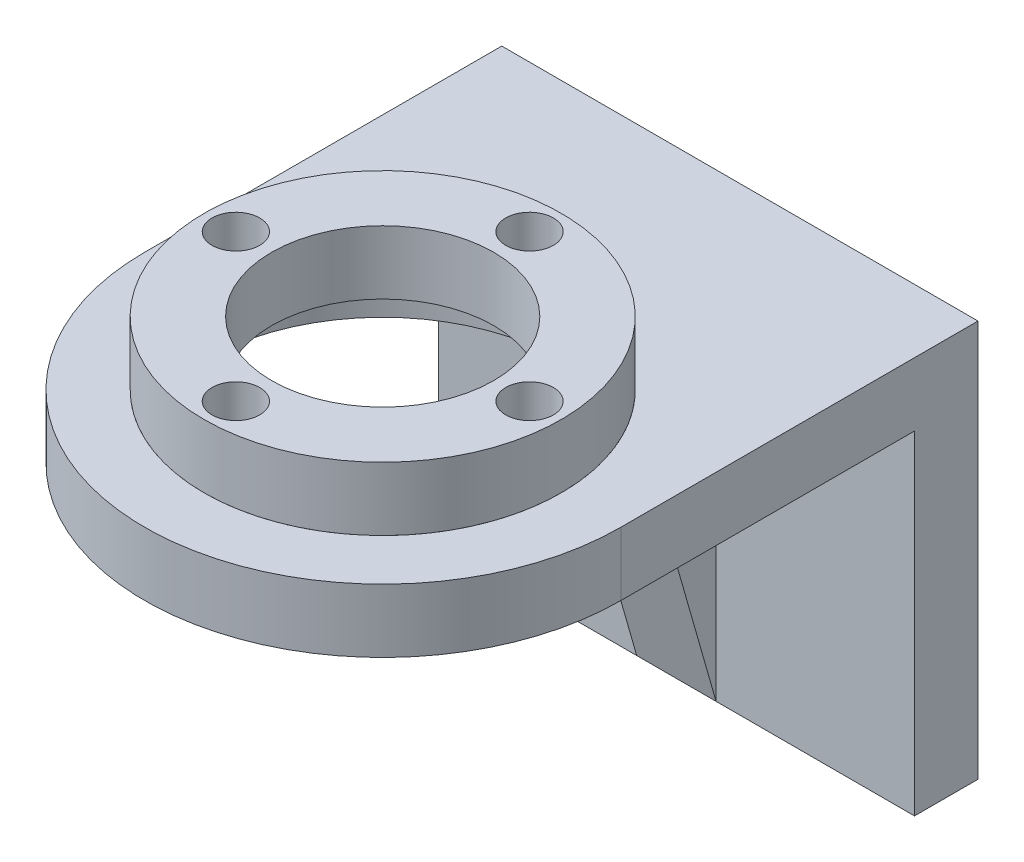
ISO-10303-21;
HEADER;
FILE_DESCRIPTION(('STEP AP214'),'2;1');
FILE_NAME('part.step','',(''),(''),'','','');
FILE_SCHEMA(('AUTOMOTIVE_DESIGN { 1 0 10303 214 1 1 1 1 }'));
ENDSEC;
DATA;
#1=APPLICATION_CONTEXT('core data for automotive mechanical design processes');
#2=APPLICATION_PROTOCOL_DEFINITION('international standard','automotive_design',2000,#1);
#3=PRODUCT_CONTEXT('',#1,'mechanical');
#4=PRODUCT('Part','Part','',(#3));
#5=PRODUCT_RELATED_PRODUCT_CATEGORY('part','',(#4));
#6=PRODUCT_DEFINITION_FORMATION('','',#4);
#7=PRODUCT_DEFINITION_CONTEXT('part definition',#1,'design');
#8=PRODUCT_DEFINITION('design','',#6,#7);
#9=PRODUCT_DEFINITION_SHAPE('','',#8);
#10=(LENGTH_UNIT() NAMED_UNIT(*) SI_UNIT(.MILLI.,.METRE.));
#11=(NAMED_UNIT(*) PLANE_ANGLE_UNIT() SI_UNIT($,.RADIAN.));
#12=(NAMED_UNIT(*) SI_UNIT($,.STERADIAN.) SOLID_ANGLE_UNIT());
#13=UNCERTAINTY_MEASURE_WITH_UNIT(LENGTH_MEASURE(1.E-05),#10,'distance_accuracy_value','');
#14=(GEOMETRIC_REPRESENTATION_CONTEXT(3) GLOBAL_UNCERTAINTY_ASSIGNED_CONTEXT((#13)) GLOBAL_UNIT_ASSIGNED_CONTEXT((#10,
#11,#12)) REPRESENTATION_CONTEXT('',''));
#15=CARTESIAN_POINT('',(0.,0.,0.));
#16=DIRECTION('',(0.,0.,1.));
#17=DIRECTION('',(1.,0.,0.));
#18=AXIS2_PLACEMENT_3D('',#15,#16,#17);
#19=CARTESIAN_POINT('',(0.,37.,45.));
#20=DIRECTION('',(0.,-1.,0.));
#21=DIRECTION('',(0.,0.,-1.));
#22=AXIS2_PLACEMENT_3D('',#19,#20,#21);
#23=CYLINDRICAL_SURFACE('',#22,22.5);
#24=CARTESIAN_POINT('',(0.,37.,45.));
#25=DIRECTION('',(0.,1.,0.));
#26=DIRECTION('',(0.,0.,1.));
#27=AXIS2_PLACEMENT_3D('',#24,#25,#26);
#28=CIRCLE('',#27,22.5);
#29=CARTESIAN_POINT('',(0.,37.,67.5));
#30=VERTEX_POINT('',#29);
#31=EDGE_CURVE('E11',#30,#30,#28,.T.);
#32=ORIENTED_EDGE('',*,*,#31,.F.);
#33=EDGE_LOOP('',(#32));
#34=FACE_BOUND('',#33,.T.);
#35=CARTESIAN_POINT('',(0.,29.,45.));
#36=DIRECTION('',(0.,1.,0.));
#37=DIRECTION('',(0.,0.,1.));
#38=AXIS2_PLACEMENT_3D('',#35,#36,#37);
#39=CIRCLE('',#38,22.5);
#40=CARTESIAN_POINT('',(0.,29.,67.5));
#41=VERTEX_POINT('',#40);
#42=EDGE_CURVE('E48',#41,#41,#39,.T.);
#43=ORIENTED_EDGE('',*,*,#42,.T.);
#44=EDGE_LOOP('',(#43));
#45=FACE_BOUND('',#44,.T.);
#46=ADVANCED_FACE('F45',(#34,#45),#23,.T.);
#47=CARTESIAN_POINT('',(0.,37.,45.));
#48=DIRECTION('',(0.,1.,0.));
#49=DIRECTION('',(0.,0.,1.));
#50=AXIS2_PLACEMENT_3D('',#47,#48,#49);
#51=PLANE('',#50);
#52=CARTESIAN_POINT('',(18.5,37.,44.9999999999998));
#53=DIRECTION('',(0.,-1.,0.));
#54=DIRECTION('',(0.,0.,-1.));
#55=AXIS2_PLACEMENT_3D('',#52,#53,#54);
#56=CIRCLE('',#55,3.);
#57=CARTESIAN_POINT('',(18.5,37.,41.9999999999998));
#58=VERTEX_POINT('',#57);
#59=EDGE_CURVE('E78',#58,#58,#56,.T.);
#60=ORIENTED_EDGE('',*,*,#59,.T.);
#61=EDGE_LOOP('',(#60));
#62=FACE_BOUND('',#61,.T.);
#63=CARTESIAN_POINT('',(1.29184884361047E-13,37.,63.5));
#64=DIRECTION('',(0.,-1.,0.));
#65=DIRECTION('',(0.,0.,-1.));
#66=AXIS2_PLACEMENT_3D('',#63,#64,#65);
#67=CIRCLE('',#66,3.);
#68=CARTESIAN_POINT('',(1.29184884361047E-13,37.,60.5));
#69=VERTEX_POINT('',#68);
#70=EDGE_CURVE('E72',#69,#69,#67,.T.);
#71=ORIENTED_EDGE('',*,*,#70,.T.);
#72=EDGE_LOOP('',(#71));
#73=FACE_BOUND('',#72,.T.);
#74=CARTESIAN_POINT('',(-18.5,37.,45.0000000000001));
#75=DIRECTION('',(0.,-1.,0.));
#76=DIRECTION('',(0.,0.,-1.));
#77=AXIS2_PLACEMENT_3D('',#74,#75,#76);
#78=CIRCLE('',#77,3.);
#79=CARTESIAN_POINT('',(-18.5,37.,42.0000000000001));
#80=VERTEX_POINT('',#79);
#81=EDGE_CURVE('E66',#80,#80,#78,.T.);
#82=ORIENTED_EDGE('',*,*,#81,.T.);
#83=EDGE_LOOP('',(#82));
#84=FACE_BOUND('',#83,.T.);
#85=CARTESIAN_POINT('',(0.,37.,26.5));
#86=DIRECTION('',(0.,-1.,0.));
#87=DIRECTION('',(0.,0.,-1.));
#88=AXIS2_PLACEMENT_3D('',#85,#86,#87);
#89=CIRCLE('',#88,3.);
#90=CARTESIAN_POINT('',(0.,37.,23.5));
#91=VERTEX_POINT('',#90);
#92=EDGE_CURVE('E60',#91,#91,#89,.T.);
#93=ORIENTED_EDGE('',*,*,#92,.T.);
#94=EDGE_LOOP('',(#93));
#95=FACE_BOUND('',#94,.T.);
#96=CARTESIAN_POINT('',(0.,37.,45.));
#97=DIRECTION('',(0.,-1.,0.));
#98=DIRECTION('',(0.,0.,-1.));
#99=AXIS2_PLACEMENT_3D('',#96,#97,#98);
#100=CIRCLE('',#99,14.);
#101=CARTESIAN_POINT('',(0.,37.,31.));
#102=VERTEX_POINT('',#101);
#103=EDGE_CURVE('E55',#102,#102,#100,.T.);
#104=ORIENTED_EDGE('',*,*,#103,.T.);
#105=EDGE_LOOP('',(#104));
#106=FACE_BOUND('',#105,.T.);
#107=ORIENTED_EDGE('',*,*,#31,.T.);
#108=EDGE_LOOP('',(#107));
#109=FACE_BOUND('',#108,.T.);
#110=ADVANCED_FACE('F87',(#62,#73,#84,#95,#106,#109),#51,.T.);
#111=CARTESIAN_POINT('',(0.,29.,45.));
#112=DIRECTION('',(0.,1.,0.));
#113=DIRECTION('',(0.,0.,1.));
#114=AXIS2_PLACEMENT_3D('',#111,#112,#113);
#115=PLANE('',#114);
#116=CARTESIAN_POINT('',(18.5,29.,44.9999999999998));
#117=DIRECTION('',(0.,-1.,0.));
#118=DIRECTION('',(0.,0.,-1.));
#119=AXIS2_PLACEMENT_3D('',#116,#117,#118);
#120=CIRCLE('',#119,3.);
#121=CARTESIAN_POINT('',(18.5,29.,41.9999999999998));
#122=VERTEX_POINT('',#121);
#123=EDGE_CURVE('E81',#122,#122,#120,.T.);
#124=ORIENTED_EDGE('',*,*,#123,.F.);
#125=EDGE_LOOP('',(#124));
#126=FACE_BOUND('',#125,.T.);
#127=CARTESIAN_POINT('',(1.29184884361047E-13,29.,63.5));
#128=DIRECTION('',(0.,-1.,0.));
#129=DIRECTION('',(0.,0.,-1.));
#130=AXIS2_PLACEMENT_3D('',#127,#128,#129);
#131=CIRCLE('',#130,3.);
#132=CARTESIAN_POINT('',(1.29184884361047E-13,29.,60.5));
#133=VERTEX_POINT('',#132);
#134=EDGE_CURVE('E75',#133,#133,#131,.T.);
#135=ORIENTED_EDGE('',*,*,#134,.F.);
#136=EDGE_LOOP('',(#135));
#137=FACE_BOUND('',#136,.T.);
#138=CARTESIAN_POINT('',(-18.5,29.,45.0000000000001));
#139=DIRECTION('',(0.,-1.,0.));
#140=DIRECTION('',(0.,0.,-1.));
#141=AXIS2_PLACEMENT_3D('',#138,#139,#140);
#142=CIRCLE('',#141,3.);
#143=CARTESIAN_POINT('',(-18.5,29.,42.0000000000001));
#144=VERTEX_POINT('',#143);
#145=EDGE_CURVE('E69',#144,#144,#142,.T.);
#146=ORIENTED_EDGE('',*,*,#145,.F.);
#147=EDGE_LOOP('',(#146));
#148=FACE_BOUND('',#147,.T.);
#149=CARTESIAN_POINT('',(0.,29.,26.5));
#150=DIRECTION('',(0.,-1.,0.));
#151=DIRECTION('',(0.,0.,-1.));
#152=AXIS2_PLACEMENT_3D('',#149,#150,#151);
#153=CIRCLE('',#152,3.);
#154=CARTESIAN_POINT('',(0.,29.,23.5));
#155=VERTEX_POINT('',#154);
#156=EDGE_CURVE('E63',#155,#155,#153,.T.);
#157=ORIENTED_EDGE('',*,*,#156,.F.);
#158=EDGE_LOOP('',(#157));
#159=FACE_BOUND('',#158,.T.);
#160=CARTESIAN_POINT('',(0.,29.,45.));
#161=DIRECTION('',(0.,-1.,0.));
#162=DIRECTION('',(0.,0.,-1.));
#163=AXIS2_PLACEMENT_3D('',#160,#161,#162);
#164=CIRCLE('',#163,14.);
#165=CARTESIAN_POINT('',(0.,29.,31.));
#166=VERTEX_POINT('',#165);
#167=EDGE_CURVE('E57',#166,#166,#164,.T.);
#168=ORIENTED_EDGE('',*,*,#167,.F.);
#169=EDGE_LOOP('',(#168));
#170=FACE_BOUND('',#169,.T.);
#171=ORIENTED_EDGE('',*,*,#42,.F.);
#172=EDGE_LOOP('',(#171));
#173=FACE_BOUND('',#172,.T.);
#174=ADVANCED_FACE('F97',(#126,#137,#148,#159,#170,#173),#115,.F.);
#175=CARTESIAN_POINT('',(0.,37.,45.));
#176=DIRECTION('',(0.,-1.,0.));
#177=DIRECTION('',(0.,0.,-1.));
#178=AXIS2_PLACEMENT_3D('',#175,#176,#177);
#179=CYLINDRICAL_SURFACE('',#178,14.);
#180=ORIENTED_EDGE('',*,*,#103,.F.);
#181=EDGE_LOOP('',(#180));
#182=FACE_BOUND('',#181,.T.);
#183=ORIENTED_EDGE('',*,*,#167,.T.);
#184=EDGE_LOOP('',(#183));
#185=FACE_BOUND('',#184,.T.);
#186=ADVANCED_FACE('F100',(#182,#185),#179,.F.);
#187=CARTESIAN_POINT('',(0.,37.,26.5));
#188=DIRECTION('',(0.,-1.,0.));
#189=DIRECTION('',(0.,0.,-1.));
#190=AXIS2_PLACEMENT_3D('',#187,#188,#189);
#191=CYLINDRICAL_SURFACE('',#190,3.);
#192=ORIENTED_EDGE('',*,*,#92,.F.);
#193=EDGE_LOOP('',(#192));
#194=FACE_BOUND('',#193,.T.);
#195=ORIENTED_EDGE('',*,*,#156,.T.);
#196=EDGE_LOOP('',(#195));
#197=FACE_BOUND('',#196,.T.);
#198=ADVANCED_FACE('F122',(#194,#197),#191,.F.);
#199=CARTESIAN_POINT('',(-18.5,37.,45.0000000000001));
#200=DIRECTION('',(0.,-1.,0.));
#201=DIRECTION('',(0.,0.,-1.));
#202=AXIS2_PLACEMENT_3D('',#199,#200,#201);
#203=CYLINDRICAL_SURFACE('',#202,3.);
#204=ORIENTED_EDGE('',*,*,#81,.F.);
#205=EDGE_LOOP('',(#204));
#206=FACE_BOUND('',#205,.T.);
#207=ORIENTED_EDGE('',*,*,#145,.T.);
#208=EDGE_LOOP('',(#207));
#209=FACE_BOUND('',#208,.T.);
#210=ADVANCED_FACE('F126',(#206,#209),#203,.F.);
#211=CARTESIAN_POINT('',(1.29184884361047E-13,37.,63.5));
#212=DIRECTION('',(0.,-1.,0.));
#213=DIRECTION('',(0.,0.,-1.));
#214=AXIS2_PLACEMENT_3D('',#211,#212,#213);
#215=CYLINDRICAL_SURFACE('',#214,3.);
#216=ORIENTED_EDGE('',*,*,#70,.F.);
#217=EDGE_LOOP('',(#216));
#218=FACE_BOUND('',#217,.T.);
#219=ORIENTED_EDGE('',*,*,#134,.T.);
#220=EDGE_LOOP('',(#219));
#221=FACE_BOUND('',#220,.T.);
#222=ADVANCED_FACE('F93',(#218,#221),#215,.F.);
#223=CARTESIAN_POINT('',(18.5,37.,44.9999999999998));
#224=DIRECTION('',(0.,-1.,0.));
#225=DIRECTION('',(0.,0.,-1.));
#226=AXIS2_PLACEMENT_3D('',#223,#224,#225);
#227=CYLINDRICAL_SURFACE('',#226,3.);
#228=ORIENTED_EDGE('',*,*,#59,.F.);
#229=EDGE_LOOP('',(#228));
#230=FACE_BOUND('',#229,.T.);
#231=ORIENTED_EDGE('',*,*,#123,.T.);
#232=EDGE_LOOP('',(#231));
#233=FACE_BOUND('',#232,.T.);
#234=ADVANCED_FACE('F90',(#230,#233),#227,.F.);
#235=CLOSED_SHELL('',(#46,#110,#174,#186,#198,#210,#222,#234));
#236=MANIFOLD_SOLID_BREP('B2',#235);
#237=CARTESIAN_POINT('',(0.,0.,8.));
#238=DIRECTION('',(0.,0.,1.));
#239=DIRECTION('',(1.,0.,0.));
#240=AXIS2_PLACEMENT_3D('',#237,#238,#239);
#241=PLANE('',#240);
#242=CARTESIAN_POINT('',(-20.,-11.,8.));
#243=DIRECTION('',(0.,0.,1.));
#244=DIRECTION('',(1.,0.,0.));
#245=AXIS2_PLACEMENT_3D('',#242,#243,#244);
#246=CIRCLE('',#245,6.);
#247=CARTESIAN_POINT('',(-14.,-11.,8.));
#248=VERTEX_POINT('',#247);
#249=EDGE_CURVE('E366',#248,#248,#246,.T.);
#250=ORIENTED_EDGE('',*,*,#249,.F.);
#251=EDGE_LOOP('',(#250));
#252=FACE_BOUND('',#251,.T.);
#253=DIRECTION('',(1.,0.,0.));
#254=VECTOR('',#253,1.);
#255=CARTESIAN_POINT('',(-30.,-21.,8.));
#256=LINE('',#255,#254);
#257=CARTESIAN_POINT('',(-30.,-21.,8.));
#258=VERTEX_POINT('',#257);
#259=CARTESIAN_POINT('',(-5.,-21.,8.));
#260=VERTEX_POINT('',#259);
#261=EDGE_CURVE('E291',#258,#260,#256,.T.);
#262=ORIENTED_EDGE('',*,*,#261,.T.);
#263=DIRECTION('',(0.,1.,0.));
#264=VECTOR('',#263,1.);
#265=CARTESIAN_POINT('',(-5.,0.,8.));
#266=LINE('',#265,#264);
#267=CARTESIAN_POINT('',(-5.,21.,8.));
#268=VERTEX_POINT('',#267);
#269=EDGE_CURVE('E272',#260,#268,#266,.T.);
#270=ORIENTED_EDGE('',*,*,#269,.T.);
#271=DIRECTION('',(-1.,0.,0.));
#272=VECTOR('',#271,1.);
#273=CARTESIAN_POINT('',(-30.,21.,8.));
#274=LINE('',#273,#272);
#275=CARTESIAN_POINT('',(-30.,21.,8.));
#276=VERTEX_POINT('',#275);
#277=EDGE_CURVE('E195',#268,#276,#274,.T.);
#278=ORIENTED_EDGE('',*,*,#277,.T.);
#279=DIRECTION('',(0.,-1.,0.));
#280=VECTOR('',#279,1.);
#281=CARTESIAN_POINT('',(-30.,21.,8.));
#282=LINE('',#281,#280);
#283=EDGE_CURVE('E295',#276,#258,#282,.T.);
#284=ORIENTED_EDGE('',*,*,#283,.T.);
#285=EDGE_LOOP('',(#262,#270,#278,#284));
#286=FACE_BOUND('',#285,.T.);
#287=ADVANCED_FACE('F191',(#252,#286),#241,.T.);
#288=CARTESIAN_POINT('',(30.,21.,8.));
#289=DIRECTION('',(-1.,0.,0.));
#290=DIRECTION('',(0.,0.,1.));
#291=AXIS2_PLACEMENT_3D('',#288,#289,#290);
#292=PLANE('',#291);
#293=DIRECTION('',(0.,1.,0.));
#294=VECTOR('',#293,1.);
#295=CARTESIAN_POINT('',(30.,21.,0.));
#296=LINE('',#295,#294);
#297=CARTESIAN_POINT('',(30.,-21.,0.));
#298=VERTEX_POINT('',#297);
#299=CARTESIAN_POINT('',(30.,29.,0.));
#300=VERTEX_POINT('',#299);
#301=EDGE_CURVE('E302',#298,#300,#296,.T.);
#302=ORIENTED_EDGE('',*,*,#301,.T.);
#303=DIRECTION('',(0.,0.,-1.));
#304=VECTOR('',#303,1.);
#305=CARTESIAN_POINT('',(30.,29.,0.));
#306=LINE('',#305,#304);
#307=CARTESIAN_POINT('',(30.,29.,45.));
#308=VERTEX_POINT('',#307);
#309=EDGE_CURVE('E345',#308,#300,#306,.T.);
#310=ORIENTED_EDGE('',*,*,#309,.F.);
#311=DIRECTION('',(0.,-1.,0.));
#312=VECTOR('',#311,1.);
#313=CARTESIAN_POINT('',(30.,29.,45.));
#314=LINE('',#313,#312);
#315=CARTESIAN_POINT('',(30.,21.,45.));
#316=VERTEX_POINT('',#315);
#317=EDGE_CURVE('E326',#308,#316,#314,.T.);
#318=ORIENTED_EDGE('',*,*,#317,.T.);
#319=DIRECTION('',(0.,0.,-1.));
#320=VECTOR('',#319,1.);
#321=CARTESIAN_POINT('',(30.,21.,0.));
#322=LINE('',#321,#320);
#323=CARTESIAN_POINT('',(30.,21.,7.99999999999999));
#324=VERTEX_POINT('',#323);
#325=EDGE_CURVE('E323',#316,#324,#322,.T.);
#326=ORIENTED_EDGE('',*,*,#325,.T.);
#327=DIRECTION('',(0.,1.,0.));
#328=VECTOR('',#327,1.);
#329=CARTESIAN_POINT('',(30.,21.,8.));
#330=LINE('',#329,#328);
#331=CARTESIAN_POINT('',(30.,-21.,8.));
#332=VERTEX_POINT('',#331);
#333=EDGE_CURVE('E307',#332,#324,#330,.T.);
#334=ORIENTED_EDGE('',*,*,#333,.F.);
#335=DIRECTION('',(0.,0.,-1.));
#336=VECTOR('',#335,1.);
#337=CARTESIAN_POINT('',(30.,-21.,8.));
#338=LINE('',#337,#336);
#339=EDGE_CURVE('E201',#332,#298,#338,.T.);
#340=ORIENTED_EDGE('',*,*,#339,.T.);
#341=EDGE_LOOP('',(#302,#310,#318,#326,#334,#340));
#342=FACE_BOUND('',#341,.T.);
#343=ADVANCED_FACE('F193',(#342),#292,.F.);
#344=CARTESIAN_POINT('',(-30.,21.,8.));
#345=DIRECTION('',(1.,0.,0.));
#346=DIRECTION('',(0.,1.,0.));
#347=AXIS2_PLACEMENT_3D('',#344,#345,#346);
#348=PLANE('',#347);
#349=DIRECTION('',(0.,-1.,0.));
#350=VECTOR('',#349,1.);
#351=CARTESIAN_POINT('',(-30.,21.,0.));
#352=LINE('',#351,#350);
#353=CARTESIAN_POINT('',(-30.,29.,0.));
#354=VERTEX_POINT('',#353);
#355=CARTESIAN_POINT('',(-30.,-21.,0.));
#356=VERTEX_POINT('',#355);
#357=EDGE_CURVE('E304',#354,#356,#352,.T.);
#358=ORIENTED_EDGE('',*,*,#357,.T.);
#359=DIRECTION('',(0.,0.,-1.));
#360=VECTOR('',#359,1.);
#361=CARTESIAN_POINT('',(-30.,-21.,8.));
#362=LINE('',#361,#360);
#363=EDGE_CURVE('E43',#258,#356,#362,.T.);
#364=ORIENTED_EDGE('',*,*,#363,.F.);
#365=ORIENTED_EDGE('',*,*,#283,.F.);
#366=DIRECTION('',(0.,0.,1.));
#367=VECTOR('',#366,1.);
#368=CARTESIAN_POINT('',(-30.,21.,0.));
#369=LINE('',#368,#367);
#370=CARTESIAN_POINT('',(-30.,21.,45.));
#371=VERTEX_POINT('',#370);
#372=EDGE_CURVE('E329',#276,#371,#369,.T.);
#373=ORIENTED_EDGE('',*,*,#372,.T.);
#374=DIRECTION('',(0.,-1.,0.));
#375=VECTOR('',#374,1.);
#376=CARTESIAN_POINT('',(-30.,29.,45.));
#377=LINE('',#376,#375);
#378=CARTESIAN_POINT('',(-30.,29.,45.));
#379=VERTEX_POINT('',#378);
#380=EDGE_CURVE('E305',#379,#371,#377,.T.);
#381=ORIENTED_EDGE('',*,*,#380,.F.);
#382=DIRECTION('',(0.,0.,1.));
#383=VECTOR('',#382,1.);
#384=CARTESIAN_POINT('',(-30.,29.,0.));
#385=LINE('',#384,#383);
#386=EDGE_CURVE('E347',#354,#379,#385,.T.);
#387=ORIENTED_EDGE('',*,*,#386,.F.);
#388=EDGE_LOOP('',(#358,#364,#365,#373,#381,#387));
#389=FACE_BOUND('',#388,.T.);
#390=ADVANCED_FACE('F386',(#389),#348,.F.);
#391=CARTESIAN_POINT('',(-30.,-21.,8.));
#392=DIRECTION('',(0.,1.,0.));
#393=DIRECTION('',(0.,0.,1.));
#394=AXIS2_PLACEMENT_3D('',#391,#392,#393);
#395=PLANE('',#394);
#396=CARTESIAN_POINT('',(5.,-21.,8.));
#397=VERTEX_POINT('',#396);
#398=EDGE_CURVE('E218',#397,#332,#256,.T.);
#399=ORIENTED_EDGE('',*,*,#398,.F.);
#400=DIRECTION('',(-1.,0.,0.));
#401=VECTOR('',#400,1.);
#402=CARTESIAN_POINT('',(0.,-21.,8.));
#403=LINE('',#402,#401);
#404=EDGE_CURVE('E283',#260,#397,#403,.F.);
#405=ORIENTED_EDGE('',*,*,#404,.F.);
#406=ORIENTED_EDGE('',*,*,#261,.F.);
#407=ORIENTED_EDGE('',*,*,#363,.T.);
#408=DIRECTION('',(1.,0.,0.));
#409=VECTOR('',#408,1.);
#410=CARTESIAN_POINT('',(-30.,-21.,0.));
#411=LINE('',#410,#409);
#412=EDGE_CURVE('E232',#356,#298,#411,.T.);
#413=ORIENTED_EDGE('',*,*,#412,.T.);
#414=ORIENTED_EDGE('',*,*,#339,.F.);
#415=EDGE_LOOP('',(#399,#405,#406,#407,#413,#414));
#416=FACE_BOUND('',#415,.T.);
#417=ADVANCED_FACE('F290',(#416),#395,.F.);
#418=DIRECTION('',(0.,1.,0.));
#419=VECTOR('',#418,1.);
#420=CARTESIAN_POINT('',(5.,0.,8.));
#421=LINE('',#420,#419);
#422=CARTESIAN_POINT('',(5.,21.,8.));
#423=VERTEX_POINT('',#422);
#424=EDGE_CURVE('E362',#397,#423,#421,.T.);
#425=ORIENTED_EDGE('',*,*,#424,.F.);
#426=ORIENTED_EDGE('',*,*,#398,.T.);
#427=ORIENTED_EDGE('',*,*,#333,.T.);
#428=EDGE_CURVE('E309',#324,#423,#274,.T.);
#429=ORIENTED_EDGE('',*,*,#428,.T.);
#430=EDGE_LOOP('',(#425,#426,#427,#429));
#431=FACE_BOUND('',#430,.T.);
#432=ADVANCED_FACE('F317',(#431),#241,.T.);
#433=CARTESIAN_POINT('',(0.,0.,0.));
#434=DIRECTION('',(0.,0.,1.));
#435=DIRECTION('',(1.,0.,0.));
#436=AXIS2_PLACEMENT_3D('',#433,#434,#435);
#437=PLANE('',#436);
#438=CARTESIAN_POINT('',(-20.,-11.,0.));
#439=DIRECTION('',(0.,0.,1.));
#440=DIRECTION('',(1.,0.,0.));
#441=AXIS2_PLACEMENT_3D('',#438,#439,#440);
#442=CIRCLE('',#441,6.);
#443=CARTESIAN_POINT('',(-14.,-11.,0.));
#444=VERTEX_POINT('',#443);
#445=EDGE_CURVE('E287',#444,#444,#442,.T.);
#446=ORIENTED_EDGE('',*,*,#445,.T.);
#447=EDGE_LOOP('',(#446));
#448=FACE_BOUND('',#447,.T.);
#449=ORIENTED_EDGE('',*,*,#301,.F.);
#450=ORIENTED_EDGE('',*,*,#412,.F.);
#451=ORIENTED_EDGE('',*,*,#357,.F.);
#452=DIRECTION('',(-1.,0.,0.));
#453=VECTOR('',#452,1.);
#454=CARTESIAN_POINT('',(30.,29.,0.));
#455=LINE('',#454,#453);
#456=EDGE_CURVE('E351',#300,#354,#455,.T.);
#457=ORIENTED_EDGE('',*,*,#456,.F.);
#458=EDGE_LOOP('',(#449,#450,#451,#457));
#459=FACE_BOUND('',#458,.T.);
#460=ADVANCED_FACE('F372',(#448,#459),#437,.F.);
#461=CARTESIAN_POINT('',(0.,21.,45.));
#462=DIRECTION('',(0.,-1.,0.));
#463=DIRECTION('',(0.,0.,-1.));
#464=AXIS2_PLACEMENT_3D('',#461,#462,#463);
#465=PLANE('',#464);
#466=DIRECTION('',(0.,0.,1.));
#467=VECTOR('',#466,1.);
#468=CARTESIAN_POINT('',(5.,21.,45.));
#469=LINE('',#468,#467);
#470=CARTESIAN_POINT('',(5.,21.,20.));
#471=VERTEX_POINT('',#470);
#472=EDGE_CURVE('E360',#423,#471,#469,.T.);
#473=ORIENTED_EDGE('',*,*,#472,.F.);
#474=ORIENTED_EDGE('',*,*,#428,.F.);
#475=ORIENTED_EDGE('',*,*,#325,.F.);
#476=CARTESIAN_POINT('',(0.,21.,45.));
#477=DIRECTION('',(0.,1.,0.));
#478=DIRECTION('',(0.,0.,-1.));
#479=AXIS2_PLACEMENT_3D('',#476,#477,#478);
#480=CIRCLE('',#479,30.);
#481=EDGE_CURVE('E332',#371,#316,#480,.T.);
#482=ORIENTED_EDGE('',*,*,#481,.F.);
#483=ORIENTED_EDGE('',*,*,#372,.F.);
#484=ORIENTED_EDGE('',*,*,#277,.F.);
#485=DIRECTION('',(0.,0.,1.));
#486=VECTOR('',#485,1.);
#487=CARTESIAN_POINT('',(-5.,21.,45.));
#488=LINE('',#487,#486);
#489=CARTESIAN_POINT('',(-5.,21.,20.));
#490=VERTEX_POINT('',#489);
#491=EDGE_CURVE('E275',#268,#490,#488,.T.);
#492=ORIENTED_EDGE('',*,*,#491,.T.);
#493=DIRECTION('',(1.,0.,0.));
#494=VECTOR('',#493,1.);
#495=CARTESIAN_POINT('',(0.,21.,20.));
#496=LINE('',#495,#494);
#497=EDGE_CURVE('E286',#471,#490,#496,.F.);
#498=ORIENTED_EDGE('',*,*,#497,.F.);
#499=EDGE_LOOP('',(#473,#474,#475,#482,#483,#484,#492,#498));
#500=FACE_BOUND('',#499,.T.);
#501=CARTESIAN_POINT('',(0.,21.,45.));
#502=DIRECTION('',(0.,-1.,0.));
#503=DIRECTION('',(0.,0.,-1.));
#504=AXIS2_PLACEMENT_3D('',#501,#502,#503);
#505=CIRCLE('',#504,22.5);
#506=CARTESIAN_POINT('',(0.,21.,22.5));
#507=VERTEX_POINT('',#506);
#508=EDGE_CURVE('E292',#507,#507,#505,.T.);
#509=ORIENTED_EDGE('',*,*,#508,.F.);
#510=EDGE_LOOP('',(#509));
#511=FACE_BOUND('',#510,.T.);
#512=ADVANCED_FACE('F394',(#500,#511),#465,.T.);
#513=CARTESIAN_POINT('',(0.,29.,45.));
#514=DIRECTION('',(0.,-1.,0.));
#515=DIRECTION('',(0.,0.,-1.));
#516=AXIS2_PLACEMENT_3D('',#513,#514,#515);
#517=CYLINDRICAL_SURFACE('',#516,30.);
#518=ORIENTED_EDGE('',*,*,#481,.T.);
#519=ORIENTED_EDGE('',*,*,#317,.F.);
#520=CARTESIAN_POINT('',(0.,29.,45.));
#521=DIRECTION('',(0.,1.,0.));
#522=DIRECTION('',(0.,0.,-1.));
#523=AXIS2_PLACEMENT_3D('',#520,#521,#522);
#524=CIRCLE('',#523,30.);
#525=EDGE_CURVE('E341',#379,#308,#524,.T.);
#526=ORIENTED_EDGE('',*,*,#525,.F.);
#527=ORIENTED_EDGE('',*,*,#380,.T.);
#528=EDGE_LOOP('',(#518,#519,#526,#527));
#529=FACE_BOUND('',#528,.T.);
#530=ADVANCED_FACE('F407',(#529),#517,.T.);
#531=CARTESIAN_POINT('',(0.,29.,45.));
#532=DIRECTION('',(0.,-1.,0.));
#533=DIRECTION('',(0.,0.,-1.));
#534=AXIS2_PLACEMENT_3D('',#531,#532,#533);
#535=PLANE('',#534);
#536=CARTESIAN_POINT('',(0.,29.,45.));
#537=DIRECTION('',(0.,-1.,0.));
#538=DIRECTION('',(0.,0.,-1.));
#539=AXIS2_PLACEMENT_3D('',#536,#537,#538);
#540=CIRCLE('',#539,22.5);
#541=CARTESIAN_POINT('',(0.,29.,22.5));
#542=VERTEX_POINT('',#541);
#543=EDGE_CURVE('E330',#542,#542,#540,.T.);
#544=ORIENTED_EDGE('',*,*,#543,.T.);
#545=EDGE_LOOP('',(#544));
#546=FACE_BOUND('',#545,.T.);
#547=ORIENTED_EDGE('',*,*,#456,.T.);
#548=ORIENTED_EDGE('',*,*,#386,.T.);
#549=ORIENTED_EDGE('',*,*,#525,.T.);
#550=ORIENTED_EDGE('',*,*,#309,.T.);
#551=EDGE_LOOP('',(#547,#548,#549,#550));
#552=FACE_BOUND('',#551,.T.);
#553=ADVANCED_FACE('F404',(#546,#552),#535,.F.);
#554=CARTESIAN_POINT('',(0.,29.,45.));
#555=DIRECTION('',(0.,-1.,0.));
#556=DIRECTION('',(0.,0.,-1.));
#557=AXIS2_PLACEMENT_3D('',#554,#555,#556);
#558=CYLINDRICAL_SURFACE('',#557,22.5);
#559=ORIENTED_EDGE('',*,*,#543,.F.);
#560=EDGE_LOOP('',(#559));
#561=FACE_BOUND('',#560,.T.);
#562=ORIENTED_EDGE('',*,*,#508,.T.);
#563=EDGE_LOOP('',(#562));
#564=FACE_BOUND('',#563,.T.);
#565=ADVANCED_FACE('F406',(#561,#564),#558,.F.);
#566=CARTESIAN_POINT('',(0.,-21.,8.));
#567=DIRECTION('',(0.,0.274721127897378,-0.961523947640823));
#568=DIRECTION('',(0.,0.961523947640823,0.274721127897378));
#569=AXIS2_PLACEMENT_3D('',#566,#567,#568);
#570=PLANE('',#569);
#571=DIRECTION('',(0.,0.961523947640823,0.274721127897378));
#572=VECTOR('',#571,1.);
#573=CARTESIAN_POINT('',(-5.,-21.,8.));
#574=LINE('',#573,#572);
#575=EDGE_CURVE('E209',#260,#490,#574,.T.);
#576=ORIENTED_EDGE('',*,*,#575,.F.);
#577=ORIENTED_EDGE('',*,*,#404,.T.);
#578=DIRECTION('',(0.,0.961523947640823,0.274721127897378));
#579=VECTOR('',#578,1.);
#580=CARTESIAN_POINT('',(5.,-21.,8.));
#581=LINE('',#580,#579);
#582=EDGE_CURVE('E277',#397,#471,#581,.T.);
#583=ORIENTED_EDGE('',*,*,#582,.T.);
#584=ORIENTED_EDGE('',*,*,#497,.T.);
#585=EDGE_LOOP('',(#576,#577,#583,#584));
#586=FACE_BOUND('',#585,.T.);
#587=ADVANCED_FACE('F281',(#586),#570,.F.);
#588=CARTESIAN_POINT('',(5.,3.9999875,37.5));
#589=DIRECTION('',(1.,0.,0.));
#590=DIRECTION('',(0.,0.,-1.));
#591=AXIS2_PLACEMENT_3D('',#588,#589,#590);
#592=PLANE('',#591);
#593=ORIENTED_EDGE('',*,*,#424,.T.);
#594=ORIENTED_EDGE('',*,*,#472,.T.);
#595=ORIENTED_EDGE('',*,*,#582,.F.);
#596=EDGE_LOOP('',(#593,#594,#595));
#597=FACE_BOUND('',#596,.T.);
#598=ADVANCED_FACE('F427',(#597),#592,.T.);
#599=CARTESIAN_POINT('',(-5.,3.9999875,37.5));
#600=DIRECTION('',(1.,0.,0.));
#601=DIRECTION('',(0.,0.,-1.));
#602=AXIS2_PLACEMENT_3D('',#599,#600,#601);
#603=PLANE('',#602);
#604=ORIENTED_EDGE('',*,*,#491,.F.);
#605=ORIENTED_EDGE('',*,*,#269,.F.);
#606=ORIENTED_EDGE('',*,*,#575,.T.);
#607=EDGE_LOOP('',(#604,#605,#606));
#608=FACE_BOUND('',#607,.T.);
#609=ADVANCED_FACE('F273',(#608),#603,.F.);
#610=CARTESIAN_POINT('',(-20.,-11.,0.));
#611=DIRECTION('',(0.,0.,1.));
#612=DIRECTION('',(1.,0.,0.));
#613=AXIS2_PLACEMENT_3D('',#610,#611,#612);
#614=CYLINDRICAL_SURFACE('',#613,6.);
#615=ORIENTED_EDGE('',*,*,#445,.F.);
#616=EDGE_LOOP('',(#615));
#617=FACE_BOUND('',#616,.T.);
#618=ORIENTED_EDGE('',*,*,#249,.T.);
#619=EDGE_LOOP('',(#618));
#620=FACE_BOUND('',#619,.T.);
#621=ADVANCED_FACE('F375',(#617,#620),#614,.F.);
#622=CLOSED_SHELL('',(#287,#343,#390,#417,#432,#460,#512,#530,#553,#565,#587,#598,#609,#621));
#623=MANIFOLD_SOLID_BREP('B6',#622);
#624=ADVANCED_BREP_SHAPE_REPRESENTATION('',(#18,#236,#623),#14);
#625=SHAPE_DEFINITION_REPRESENTATION(#9,#624);
ENDSEC;
END-ISO-10303-21;
